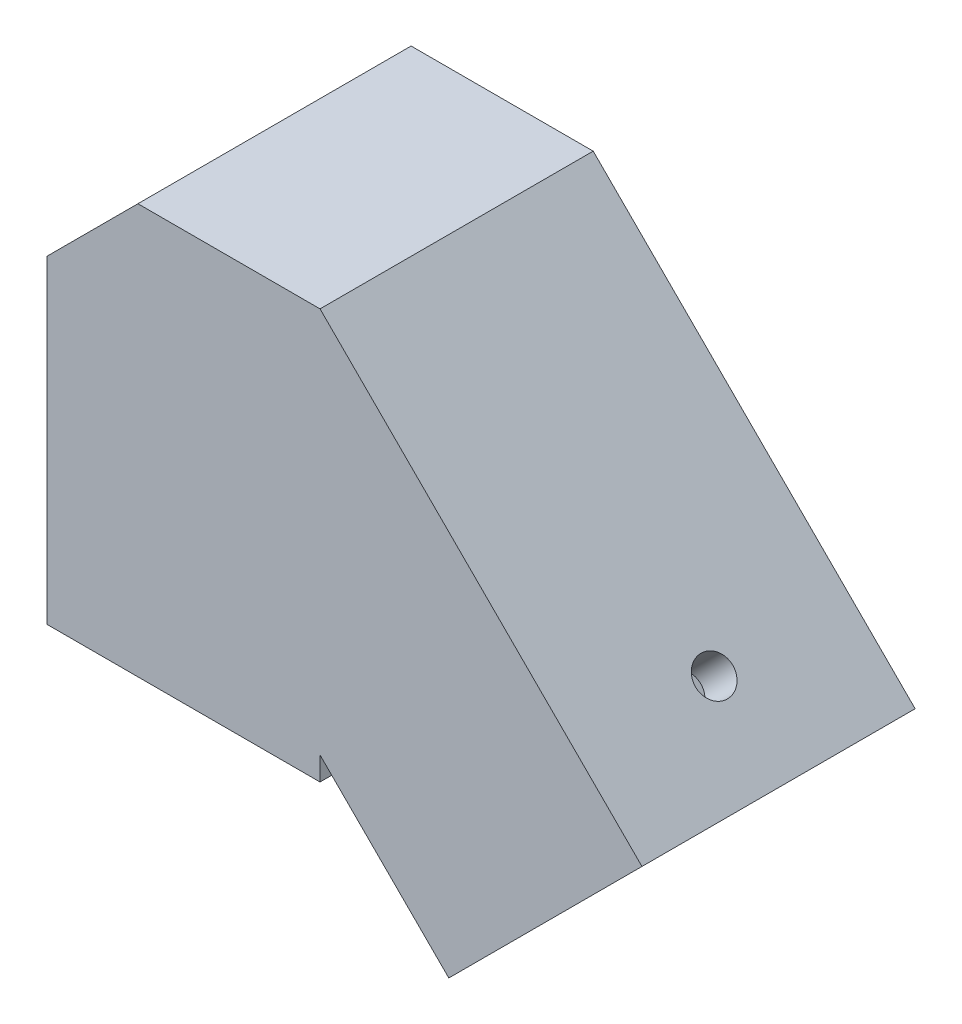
ISO-10303-21;
HEADER;
FILE_DESCRIPTION(('STEP AP214'),'2;1');
FILE_NAME('part.step','',(''),(''),'','','');
FILE_SCHEMA(('AUTOMOTIVE_DESIGN { 1 0 10303 214 1 1 1 1 }'));
ENDSEC;
DATA;
#1=APPLICATION_CONTEXT('core data for automotive mechanical design processes');
#2=APPLICATION_PROTOCOL_DEFINITION('international standard','automotive_design',2000,#1);
#3=PRODUCT_CONTEXT('',#1,'mechanical');
#4=PRODUCT('Part','Part','',(#3));
#5=PRODUCT_RELATED_PRODUCT_CATEGORY('part','',(#4));
#6=PRODUCT_DEFINITION_FORMATION('','',#4);
#7=PRODUCT_DEFINITION_CONTEXT('part definition',#1,'design');
#8=PRODUCT_DEFINITION('design','',#6,#7);
#9=PRODUCT_DEFINITION_SHAPE('','',#8);
#10=(LENGTH_UNIT() NAMED_UNIT(*) SI_UNIT(.MILLI.,.METRE.));
#11=(NAMED_UNIT(*) PLANE_ANGLE_UNIT() SI_UNIT($,.RADIAN.));
#12=(NAMED_UNIT(*) SI_UNIT($,.STERADIAN.) SOLID_ANGLE_UNIT());
#13=UNCERTAINTY_MEASURE_WITH_UNIT(LENGTH_MEASURE(1.E-05),#10,'distance_accuracy_value','');
#14=(GEOMETRIC_REPRESENTATION_CONTEXT(3) GLOBAL_UNCERTAINTY_ASSIGNED_CONTEXT((#13)) GLOBAL_UNIT_ASSIGNED_CONTEXT((#10,
#11,#12)) REPRESENTATION_CONTEXT('',''));
#15=CARTESIAN_POINT('',(0.,0.,0.));
#16=DIRECTION('',(0.,0.,1.));
#17=DIRECTION('',(1.,0.,0.));
#18=AXIS2_PLACEMENT_3D('',#15,#16,#17);
#19=CARTESIAN_POINT('',(15.,-25.,15.));
#20=DIRECTION('',(1.,0.,0.));
#21=DIRECTION('',(0.,0.,-1.));
#22=AXIS2_PLACEMENT_3D('',#19,#20,#21);
#23=PLANE('',#22);
#24=DIRECTION('',(0.,1.,0.));
#25=VECTOR('',#24,1.);
#26=CARTESIAN_POINT('',(15.,-25.,-15.));
#27=LINE('',#26,#25);
#28=CARTESIAN_POINT('',(15.,-25.,-15.));
#29=VERTEX_POINT('',#28);
#30=CARTESIAN_POINT('',(15.,-22.4264068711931,-15.));
#31=VERTEX_POINT('',#30);
#32=EDGE_CURVE('E324',#29,#31,#27,.T.);
#33=ORIENTED_EDGE('',*,*,#32,.T.);
#34=DIRECTION('',(0.,0.,1.));
#35=VECTOR('',#34,1.);
#36=CARTESIAN_POINT('',(15.,-22.4264068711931,-81.7083203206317));
#37=LINE('',#36,#35);
#38=CARTESIAN_POINT('',(15.,-22.4264068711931,15.));
#39=VERTEX_POINT('',#38);
#40=EDGE_CURVE('E284',#31,#39,#37,.T.);
#41=ORIENTED_EDGE('',*,*,#40,.T.);
#42=DIRECTION('',(0.,1.,0.));
#43=VECTOR('',#42,1.);
#44=CARTESIAN_POINT('',(15.,-25.,15.));
#45=LINE('',#44,#43);
#46=CARTESIAN_POINT('',(15.,-25.,15.));
#47=VERTEX_POINT('',#46);
#48=EDGE_CURVE('E321',#47,#39,#45,.T.);
#49=ORIENTED_EDGE('',*,*,#48,.F.);
#50=DIRECTION('',(0.,0.,-1.));
#51=VECTOR('',#50,1.);
#52=CARTESIAN_POINT('',(15.,-25.,15.));
#53=LINE('',#52,#51);
#54=EDGE_CURVE('E304',#47,#29,#53,.T.);
#55=ORIENTED_EDGE('',*,*,#54,.T.);
#56=EDGE_LOOP('',(#33,#41,#49,#55));
#57=FACE_BOUND('',#56,.T.);
#58=ADVANCED_FACE('F50',(#57),#23,.T.);
#59=CARTESIAN_POINT('',(-15.,-25.,15.));
#60=DIRECTION('',(0.,0.,1.));
#61=DIRECTION('',(1.,0.,0.));
#62=AXIS2_PLACEMENT_3D('',#59,#60,#61);
#63=PLANE('',#62);
#64=DIRECTION('',(1.,0.,0.));
#65=VECTOR('',#64,1.);
#66=CARTESIAN_POINT('',(-15.,20.,15.));
#67=LINE('',#66,#65);
#68=CARTESIAN_POINT('',(-5.00000000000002,20.,15.));
#69=VERTEX_POINT('',#68);
#70=CARTESIAN_POINT('',(15.,20.,15.));
#71=VERTEX_POINT('',#70);
#72=EDGE_CURVE('E305',#69,#71,#67,.T.);
#73=ORIENTED_EDGE('',*,*,#72,.F.);
#74=DIRECTION('',(-0.707106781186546,-0.707106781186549,0.));
#75=VECTOR('',#74,1.);
#76=CARTESIAN_POINT('',(-32.5,-7.50000000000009,15.));
#77=LINE('',#76,#75);
#78=CARTESIAN_POINT('',(-15.,9.99999999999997,15.));
#79=VERTEX_POINT('',#78);
#80=EDGE_CURVE('E73',#69,#79,#77,.T.);
#81=ORIENTED_EDGE('',*,*,#80,.T.);
#82=DIRECTION('',(0.,1.,0.));
#83=VECTOR('',#82,1.);
#84=CARTESIAN_POINT('',(-15.,-25.,15.));
#85=LINE('',#84,#83);
#86=CARTESIAN_POINT('',(-15.,-25.,15.));
#87=VERTEX_POINT('',#86);
#88=EDGE_CURVE('E326',#87,#79,#85,.T.);
#89=ORIENTED_EDGE('',*,*,#88,.F.);
#90=DIRECTION('',(1.,0.,0.));
#91=VECTOR('',#90,1.);
#92=CARTESIAN_POINT('',(-15.,-25.,15.));
#93=LINE('',#92,#91);
#94=EDGE_CURVE('E320',#87,#47,#93,.T.);
#95=ORIENTED_EDGE('',*,*,#94,.T.);
#96=ORIENTED_EDGE('',*,*,#48,.T.);
#97=DIRECTION('',(0.707106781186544,-0.707106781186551,0.));
#98=VECTOR('',#97,1.);
#99=CARTESIAN_POINT('',(15.,-22.4264068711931,15.));
#100=LINE('',#99,#98);
#101=CARTESIAN_POINT('',(29.1421356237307,-36.5685424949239,15.));
#102=VERTEX_POINT('',#101);
#103=EDGE_CURVE('E255',#39,#102,#100,.T.);
#104=ORIENTED_EDGE('',*,*,#103,.T.);
#105=DIRECTION('',(0.707106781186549,0.707106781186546,0.));
#106=VECTOR('',#105,1.);
#107=CARTESIAN_POINT('',(29.1421356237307,-36.5685424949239,15.));
#108=LINE('',#107,#106);
#109=CARTESIAN_POINT('',(50.3553390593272,-15.3553390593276,15.));
#110=VERTEX_POINT('',#109);
#111=EDGE_CURVE('E269',#102,#110,#108,.T.);
#112=ORIENTED_EDGE('',*,*,#111,.T.);
#113=DIRECTION('',(-0.707106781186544,0.707106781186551,0.));
#114=VECTOR('',#113,1.);
#115=CARTESIAN_POINT('',(15.,20.,15.));
#116=LINE('',#115,#114);
#117=EDGE_CURVE('E261',#110,#71,#116,.T.);
#118=ORIENTED_EDGE('',*,*,#117,.T.);
#119=EDGE_LOOP('',(#73,#81,#89,#95,#96,#104,#112,#118));
#120=FACE_BOUND('',#119,.T.);
#121=ADVANCED_FACE('F350',(#120),#63,.T.);
#122=CARTESIAN_POINT('',(-15.,-25.,15.));
#123=DIRECTION('',(-1.,0.,0.));
#124=DIRECTION('',(0.,0.,1.));
#125=AXIS2_PLACEMENT_3D('',#122,#123,#124);
#126=PLANE('',#125);
#127=CARTESIAN_POINT('',(-15.,-15.,0.));
#128=DIRECTION('',(-1.,0.,0.));
#129=DIRECTION('',(0.,0.,1.));
#130=AXIS2_PLACEMENT_3D('',#127,#128,#129);
#131=CIRCLE('',#130,2.05);
#132=CARTESIAN_POINT('',(-15.,-15.,2.05));
#133=VERTEX_POINT('',#132);
#134=EDGE_CURVE('E437',#133,#133,#131,.T.);
#135=ORIENTED_EDGE('',*,*,#134,.F.);
#136=EDGE_LOOP('',(#135));
#137=FACE_BOUND('',#136,.T.);
#138=ORIENTED_EDGE('',*,*,#88,.T.);
#139=DIRECTION('',(0.,0.,-1.));
#140=VECTOR('',#139,1.);
#141=CARTESIAN_POINT('',(-15.,9.99999999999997,-15.));
#142=LINE('',#141,#140);
#143=CARTESIAN_POINT('',(-15.,9.99999999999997,-15.));
#144=VERTEX_POINT('',#143);
#145=EDGE_CURVE('E60',#79,#144,#142,.T.);
#146=ORIENTED_EDGE('',*,*,#145,.T.);
#147=DIRECTION('',(0.,1.,0.));
#148=VECTOR('',#147,1.);
#149=CARTESIAN_POINT('',(-15.,-25.,-15.));
#150=LINE('',#149,#148);
#151=CARTESIAN_POINT('',(-15.,-25.,-15.));
#152=VERTEX_POINT('',#151);
#153=EDGE_CURVE('E327',#152,#144,#150,.T.);
#154=ORIENTED_EDGE('',*,*,#153,.F.);
#155=DIRECTION('',(0.,0.,1.));
#156=VECTOR('',#155,1.);
#157=CARTESIAN_POINT('',(-15.,-25.,15.));
#158=LINE('',#157,#156);
#159=EDGE_CURVE('E312',#152,#87,#158,.T.);
#160=ORIENTED_EDGE('',*,*,#159,.T.);
#161=EDGE_LOOP('',(#138,#146,#154,#160));
#162=FACE_BOUND('',#161,.T.);
#163=ADVANCED_FACE('F372',(#137,#162),#126,.T.);
#164=CARTESIAN_POINT('',(-15.,-25.,-15.));
#165=DIRECTION('',(0.,0.,-1.));
#166=DIRECTION('',(-1.,0.,0.));
#167=AXIS2_PLACEMENT_3D('',#164,#165,#166);
#168=PLANE('',#167);
#169=ORIENTED_EDGE('',*,*,#153,.T.);
#170=DIRECTION('',(0.707106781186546,0.707106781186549,0.));
#171=VECTOR('',#170,1.);
#172=CARTESIAN_POINT('',(-32.5,-7.50000000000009,-15.));
#173=LINE('',#172,#171);
#174=CARTESIAN_POINT('',(-5.00000000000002,20.,-15.));
#175=VERTEX_POINT('',#174);
#176=EDGE_CURVE('E11',#144,#175,#173,.T.);
#177=ORIENTED_EDGE('',*,*,#176,.T.);
#178=DIRECTION('',(-1.,0.,0.));
#179=VECTOR('',#178,1.);
#180=CARTESIAN_POINT('',(-15.,20.,-15.));
#181=LINE('',#180,#179);
#182=CARTESIAN_POINT('',(15.,20.,-15.));
#183=VERTEX_POINT('',#182);
#184=EDGE_CURVE('E296',#183,#175,#181,.T.);
#185=ORIENTED_EDGE('',*,*,#184,.F.);
#186=DIRECTION('',(-0.707106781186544,0.707106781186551,0.));
#187=VECTOR('',#186,1.);
#188=CARTESIAN_POINT('',(15.,20.,-15.));
#189=LINE('',#188,#187);
#190=CARTESIAN_POINT('',(50.3553390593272,-15.3553390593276,-15.));
#191=VERTEX_POINT('',#190);
#192=EDGE_CURVE('E280',#191,#183,#189,.T.);
#193=ORIENTED_EDGE('',*,*,#192,.F.);
#194=DIRECTION('',(0.707106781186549,0.707106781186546,0.));
#195=VECTOR('',#194,1.);
#196=CARTESIAN_POINT('',(29.1421356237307,-36.5685424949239,-15.));
#197=LINE('',#196,#195);
#198=CARTESIAN_POINT('',(29.1421356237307,-36.5685424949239,-15.));
#199=VERTEX_POINT('',#198);
#200=EDGE_CURVE('E285',#199,#191,#197,.T.);
#201=ORIENTED_EDGE('',*,*,#200,.F.);
#202=DIRECTION('',(0.707106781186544,-0.707106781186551,0.));
#203=VECTOR('',#202,1.);
#204=CARTESIAN_POINT('',(15.,-22.4264068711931,-15.));
#205=LINE('',#204,#203);
#206=EDGE_CURVE('E268',#31,#199,#205,.T.);
#207=ORIENTED_EDGE('',*,*,#206,.F.);
#208=ORIENTED_EDGE('',*,*,#32,.F.);
#209=DIRECTION('',(-1.,0.,0.));
#210=VECTOR('',#209,1.);
#211=CARTESIAN_POINT('',(-15.,-25.,-15.));
#212=LINE('',#211,#210);
#213=EDGE_CURVE('E307',#29,#152,#212,.T.);
#214=ORIENTED_EDGE('',*,*,#213,.T.);
#215=EDGE_LOOP('',(#169,#177,#185,#193,#201,#207,#208,#214));
#216=FACE_BOUND('',#215,.T.);
#217=ADVANCED_FACE('F351',(#216),#168,.T.);
#218=CARTESIAN_POINT('',(0.,-25.,0.));
#219=DIRECTION('',(0.,-1.,0.));
#220=DIRECTION('',(0.,0.,-1.));
#221=AXIS2_PLACEMENT_3D('',#218,#219,#220);
#222=PLANE('',#221);
#223=DIRECTION('',(0.,0.,1.));
#224=VECTOR('',#223,1.);
#225=CARTESIAN_POINT('',(10.025,-25.,-10.025));
#226=LINE('',#225,#224);
#227=CARTESIAN_POINT('',(10.025,-25.,-10.025));
#228=VERTEX_POINT('',#227);
#229=CARTESIAN_POINT('',(10.025,-25.,10.025));
#230=VERTEX_POINT('',#229);
#231=EDGE_CURVE('E211',#228,#230,#226,.T.);
#232=ORIENTED_EDGE('',*,*,#231,.F.);
#233=DIRECTION('',(1.,0.,0.));
#234=VECTOR('',#233,1.);
#235=CARTESIAN_POINT('',(-10.025,-25.,-10.025));
#236=LINE('',#235,#234);
#237=CARTESIAN_POINT('',(-10.025,-25.,-10.025));
#238=VERTEX_POINT('',#237);
#239=EDGE_CURVE('E222',#238,#228,#236,.T.);
#240=ORIENTED_EDGE('',*,*,#239,.F.);
#241=DIRECTION('',(0.,0.,-1.));
#242=VECTOR('',#241,1.);
#243=CARTESIAN_POINT('',(-10.025,-25.,-10.025));
#244=LINE('',#243,#242);
#245=CARTESIAN_POINT('',(-10.025,-25.,10.025));
#246=VERTEX_POINT('',#245);
#247=EDGE_CURVE('E245',#246,#238,#244,.T.);
#248=ORIENTED_EDGE('',*,*,#247,.F.);
#249=DIRECTION('',(-1.,0.,0.));
#250=VECTOR('',#249,1.);
#251=CARTESIAN_POINT('',(-10.025,-25.,10.025));
#252=LINE('',#251,#250);
#253=EDGE_CURVE('E238',#230,#246,#252,.T.);
#254=ORIENTED_EDGE('',*,*,#253,.F.);
#255=EDGE_LOOP('',(#232,#240,#248,#254));
#256=FACE_BOUND('',#255,.T.);
#257=ORIENTED_EDGE('',*,*,#54,.F.);
#258=ORIENTED_EDGE('',*,*,#94,.F.);
#259=ORIENTED_EDGE('',*,*,#159,.F.);
#260=ORIENTED_EDGE('',*,*,#213,.F.);
#261=EDGE_LOOP('',(#257,#258,#259,#260));
#262=FACE_BOUND('',#261,.T.);
#263=ADVANCED_FACE('F378',(#256,#262),#222,.T.);
#264=CARTESIAN_POINT('',(0.,20.,0.));
#265=DIRECTION('',(0.,-1.,0.));
#266=DIRECTION('',(0.,0.,-1.));
#267=AXIS2_PLACEMENT_3D('',#264,#265,#266);
#268=PLANE('',#267);
#269=ORIENTED_EDGE('',*,*,#184,.T.);
#270=DIRECTION('',(0.,0.,1.));
#271=VECTOR('',#270,1.);
#272=CARTESIAN_POINT('',(-5.00000000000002,20.,15.));
#273=LINE('',#272,#271);
#274=EDGE_CURVE('E329',#175,#69,#273,.T.);
#275=ORIENTED_EDGE('',*,*,#274,.T.);
#276=ORIENTED_EDGE('',*,*,#72,.T.);
#277=DIRECTION('',(0.,0.,-1.));
#278=VECTOR('',#277,1.);
#279=CARTESIAN_POINT('',(15.,20.,15.));
#280=LINE('',#279,#278);
#281=EDGE_CURVE('E295',#71,#183,#280,.T.);
#282=ORIENTED_EDGE('',*,*,#281,.T.);
#283=EDGE_LOOP('',(#269,#275,#276,#282));
#284=FACE_BOUND('',#283,.T.);
#285=ADVANCED_FACE('F345',(#284),#268,.F.);
#286=CARTESIAN_POINT('',(15.,-22.4264068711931,-81.7083203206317));
#287=DIRECTION('',(-0.707106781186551,-0.707106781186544,0.));
#288=DIRECTION('',(0.707106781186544,-0.707106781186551,0.));
#289=AXIS2_PLACEMENT_3D('',#286,#287,#288);
#290=PLANE('',#289);
#291=ORIENTED_EDGE('',*,*,#40,.F.);
#292=ORIENTED_EDGE('',*,*,#206,.T.);
#293=DIRECTION('',(0.,0.,1.));
#294=VECTOR('',#293,1.);
#295=CARTESIAN_POINT('',(29.1421356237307,-36.5685424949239,-81.7083203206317));
#296=LINE('',#295,#294);
#297=EDGE_CURVE('E276',#199,#102,#296,.T.);
#298=ORIENTED_EDGE('',*,*,#297,.T.);
#299=ORIENTED_EDGE('',*,*,#103,.F.);
#300=EDGE_LOOP('',(#291,#292,#298,#299));
#301=FACE_BOUND('',#300,.T.);
#302=ADVANCED_FACE('F386',(#301),#290,.T.);
#303=CARTESIAN_POINT('',(29.1421356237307,-36.5685424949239,-81.7083203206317));
#304=DIRECTION('',(0.707106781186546,-0.707106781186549,0.));
#305=DIRECTION('',(0.707106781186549,0.707106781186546,0.));
#306=AXIS2_PLACEMENT_3D('',#303,#304,#305);
#307=PLANE('',#306);
#308=DIRECTION('',(0.707106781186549,0.707106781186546,0.));
#309=VECTOR('',#308,1.);
#310=CARTESIAN_POINT('',(32.6599918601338,-33.0506862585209,-10.025));
#311=LINE('',#310,#309);
#312=CARTESIAN_POINT('',(32.6599918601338,-33.0506862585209,-10.025));
#313=VERTEX_POINT('',#312);
#314=CARTESIAN_POINT('',(46.8374828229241,-18.8731952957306,-10.025));
#315=VERTEX_POINT('',#314);
#316=EDGE_CURVE('E170',#313,#315,#311,.T.);
#317=ORIENTED_EDGE('',*,*,#316,.F.);
#318=DIRECTION('',(0.,0.,-1.));
#319=VECTOR('',#318,1.);
#320=CARTESIAN_POINT('',(32.6599918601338,-33.0506862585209,10.025));
#321=LINE('',#320,#319);
#322=CARTESIAN_POINT('',(32.6599918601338,-33.0506862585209,10.025));
#323=VERTEX_POINT('',#322);
#324=EDGE_CURVE('E190',#323,#313,#321,.T.);
#325=ORIENTED_EDGE('',*,*,#324,.F.);
#326=DIRECTION('',(-0.707106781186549,-0.707106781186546,0.));
#327=VECTOR('',#326,1.);
#328=CARTESIAN_POINT('',(32.6599918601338,-33.0506862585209,10.025));
#329=LINE('',#328,#327);
#330=CARTESIAN_POINT('',(46.8374828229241,-18.8731952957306,10.025));
#331=VERTEX_POINT('',#330);
#332=EDGE_CURVE('E194',#331,#323,#329,.T.);
#333=ORIENTED_EDGE('',*,*,#332,.F.);
#334=DIRECTION('',(0.,0.,1.));
#335=VECTOR('',#334,1.);
#336=CARTESIAN_POINT('',(46.8374828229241,-18.8731952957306,10.025));
#337=LINE('',#336,#335);
#338=EDGE_CURVE('E202',#315,#331,#337,.T.);
#339=ORIENTED_EDGE('',*,*,#338,.F.);
#340=EDGE_LOOP('',(#317,#325,#333,#339));
#341=FACE_BOUND('',#340,.T.);
#342=ORIENTED_EDGE('',*,*,#297,.F.);
#343=ORIENTED_EDGE('',*,*,#200,.T.);
#344=DIRECTION('',(0.,0.,1.));
#345=VECTOR('',#344,1.);
#346=CARTESIAN_POINT('',(50.3553390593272,-15.3553390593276,-81.7083203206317));
#347=LINE('',#346,#345);
#348=EDGE_CURVE('E281',#191,#110,#347,.T.);
#349=ORIENTED_EDGE('',*,*,#348,.T.);
#350=ORIENTED_EDGE('',*,*,#111,.F.);
#351=EDGE_LOOP('',(#342,#343,#349,#350));
#352=FACE_BOUND('',#351,.T.);
#353=ADVANCED_FACE('F388',(#341,#352),#307,.T.);
#354=CARTESIAN_POINT('',(15.,20.,-81.7083203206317));
#355=DIRECTION('',(0.707106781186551,0.707106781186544,0.));
#356=DIRECTION('',(-0.707106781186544,0.707106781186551,0.));
#357=AXIS2_PLACEMENT_3D('',#354,#355,#356);
#358=PLANE('',#357);
#359=CARTESIAN_POINT('',(43.2842712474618,-8.28427124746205,0.));
#360=DIRECTION('',(0.707106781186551,0.707106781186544,0.));
#361=DIRECTION('',(-0.707106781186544,0.707106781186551,0.));
#362=AXIS2_PLACEMENT_3D('',#359,#360,#361);
#363=CIRCLE('',#362,2.05);
#364=CARTESIAN_POINT('',(41.8347023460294,-6.83470234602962,0.));
#365=VERTEX_POINT('',#364);
#366=EDGE_CURVE('E442',#365,#365,#363,.T.);
#367=ORIENTED_EDGE('',*,*,#366,.F.);
#368=EDGE_LOOP('',(#367));
#369=FACE_BOUND('',#368,.T.);
#370=ORIENTED_EDGE('',*,*,#348,.F.);
#371=ORIENTED_EDGE('',*,*,#192,.T.);
#372=ORIENTED_EDGE('',*,*,#281,.F.);
#373=ORIENTED_EDGE('',*,*,#117,.F.);
#374=EDGE_LOOP('',(#370,#371,#372,#373));
#375=FACE_BOUND('',#374,.T.);
#376=ADVANCED_FACE('F352',(#369,#375),#358,.T.);
#377=CARTESIAN_POINT('',(10.025,-5.,-10.025));
#378=DIRECTION('',(1.,0.,0.));
#379=DIRECTION('',(0.,0.,-1.));
#380=AXIS2_PLACEMENT_3D('',#377,#378,#379);
#381=PLANE('',#380);
#382=ORIENTED_EDGE('',*,*,#231,.T.);
#383=DIRECTION('',(0.,-1.,0.));
#384=VECTOR('',#383,1.);
#385=CARTESIAN_POINT('',(10.025,-5.,10.025));
#386=LINE('',#385,#384);
#387=CARTESIAN_POINT('',(10.025,-5.,10.025));
#388=VERTEX_POINT('',#387);
#389=EDGE_CURVE('E232',#388,#230,#386,.T.);
#390=ORIENTED_EDGE('',*,*,#389,.F.);
#391=DIRECTION('',(0.,0.,1.));
#392=VECTOR('',#391,1.);
#393=CARTESIAN_POINT('',(10.025,-5.,-10.025));
#394=LINE('',#393,#392);
#395=CARTESIAN_POINT('',(10.025,-5.,-10.025));
#396=VERTEX_POINT('',#395);
#397=EDGE_CURVE('E220',#396,#388,#394,.T.);
#398=ORIENTED_EDGE('',*,*,#397,.F.);
#399=DIRECTION('',(0.,-1.,0.));
#400=VECTOR('',#399,1.);
#401=CARTESIAN_POINT('',(10.025,-5.,-10.025));
#402=LINE('',#401,#400);
#403=EDGE_CURVE('E248',#396,#228,#402,.T.);
#404=ORIENTED_EDGE('',*,*,#403,.T.);
#405=EDGE_LOOP('',(#382,#390,#398,#404));
#406=FACE_BOUND('',#405,.T.);
#407=ADVANCED_FACE('F392',(#406),#381,.F.);
#408=CARTESIAN_POINT('',(-10.025,-5.,-10.025));
#409=DIRECTION('',(0.,0.,-1.));
#410=DIRECTION('',(-1.,0.,0.));
#411=AXIS2_PLACEMENT_3D('',#408,#409,#410);
#412=PLANE('',#411);
#413=ORIENTED_EDGE('',*,*,#239,.T.);
#414=ORIENTED_EDGE('',*,*,#403,.F.);
#415=DIRECTION('',(1.,0.,0.));
#416=VECTOR('',#415,1.);
#417=CARTESIAN_POINT('',(-10.025,-5.,-10.025));
#418=LINE('',#417,#416);
#419=CARTESIAN_POINT('',(-10.025,-5.,-10.025));
#420=VERTEX_POINT('',#419);
#421=EDGE_CURVE('E233',#420,#396,#418,.T.);
#422=ORIENTED_EDGE('',*,*,#421,.F.);
#423=DIRECTION('',(0.,-1.,0.));
#424=VECTOR('',#423,1.);
#425=CARTESIAN_POINT('',(-10.025,-5.,-10.025));
#426=LINE('',#425,#424);
#427=EDGE_CURVE('E254',#420,#238,#426,.T.);
#428=ORIENTED_EDGE('',*,*,#427,.T.);
#429=EDGE_LOOP('',(#413,#414,#422,#428));
#430=FACE_BOUND('',#429,.T.);
#431=ADVANCED_FACE('F400',(#430),#412,.F.);
#432=CARTESIAN_POINT('',(-10.025,-5.,-10.025));
#433=DIRECTION('',(-1.,0.,0.));
#434=DIRECTION('',(0.,0.,1.));
#435=AXIS2_PLACEMENT_3D('',#432,#433,#434);
#436=PLANE('',#435);
#437=CARTESIAN_POINT('',(-10.025,-15.,0.));
#438=DIRECTION('',(-1.,0.,0.));
#439=DIRECTION('',(0.,0.,1.));
#440=AXIS2_PLACEMENT_3D('',#437,#438,#439);
#441=CIRCLE('',#440,2.05);
#442=CARTESIAN_POINT('',(-10.025,-15.,2.05));
#443=VERTEX_POINT('',#442);
#444=EDGE_CURVE('E436',#443,#443,#441,.F.);
#445=ORIENTED_EDGE('',*,*,#444,.F.);
#446=EDGE_LOOP('',(#445));
#447=FACE_BOUND('',#446,.T.);
#448=ORIENTED_EDGE('',*,*,#247,.T.);
#449=ORIENTED_EDGE('',*,*,#427,.F.);
#450=DIRECTION('',(0.,0.,-1.));
#451=VECTOR('',#450,1.);
#452=CARTESIAN_POINT('',(-10.025,-5.,-10.025));
#453=LINE('',#452,#451);
#454=CARTESIAN_POINT('',(-10.025,-5.,10.025));
#455=VERTEX_POINT('',#454);
#456=EDGE_CURVE('E227',#455,#420,#453,.T.);
#457=ORIENTED_EDGE('',*,*,#456,.F.);
#458=DIRECTION('',(0.,-1.,0.));
#459=VECTOR('',#458,1.);
#460=CARTESIAN_POINT('',(-10.025,-5.,10.025));
#461=LINE('',#460,#459);
#462=EDGE_CURVE('E259',#455,#246,#461,.T.);
#463=ORIENTED_EDGE('',*,*,#462,.T.);
#464=EDGE_LOOP('',(#448,#449,#457,#463));
#465=FACE_BOUND('',#464,.T.);
#466=ADVANCED_FACE('F403',(#447,#465),#436,.F.);
#467=CARTESIAN_POINT('',(-10.025,-5.,10.025));
#468=DIRECTION('',(0.,0.,1.));
#469=DIRECTION('',(1.,0.,0.));
#470=AXIS2_PLACEMENT_3D('',#467,#468,#469);
#471=PLANE('',#470);
#472=ORIENTED_EDGE('',*,*,#253,.T.);
#473=ORIENTED_EDGE('',*,*,#462,.F.);
#474=DIRECTION('',(-1.,0.,0.));
#475=VECTOR('',#474,1.);
#476=CARTESIAN_POINT('',(-10.025,-5.,10.025));
#477=LINE('',#476,#475);
#478=EDGE_CURVE('E224',#388,#455,#477,.T.);
#479=ORIENTED_EDGE('',*,*,#478,.F.);
#480=ORIENTED_EDGE('',*,*,#389,.T.);
#481=EDGE_LOOP('',(#472,#473,#479,#480));
#482=FACE_BOUND('',#481,.T.);
#483=ADVANCED_FACE('F402',(#482),#471,.F.);
#484=CARTESIAN_POINT('',(0.,-5.,0.));
#485=DIRECTION('',(0.,1.,0.));
#486=DIRECTION('',(0.,0.,1.));
#487=AXIS2_PLACEMENT_3D('',#484,#485,#486);
#488=PLANE('',#487);
#489=ORIENTED_EDGE('',*,*,#397,.T.);
#490=ORIENTED_EDGE('',*,*,#478,.T.);
#491=ORIENTED_EDGE('',*,*,#456,.T.);
#492=ORIENTED_EDGE('',*,*,#421,.T.);
#493=EDGE_LOOP('',(#489,#490,#491,#492));
#494=FACE_BOUND('',#493,.T.);
#495=ADVANCED_FACE('F404',(#494),#488,.F.);
#496=CARTESIAN_POINT('',(14.9823223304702,-15.3730167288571,-10.025));
#497=DIRECTION('',(0.,0.,-1.));
#498=DIRECTION('',(-1.,0.,0.));
#499=AXIS2_PLACEMENT_3D('',#496,#497,#498);
#500=PLANE('',#499);
#501=ORIENTED_EDGE('',*,*,#316,.T.);
#502=DIRECTION('',(0.707106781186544,-0.707106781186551,0.));
#503=VECTOR('',#502,1.);
#504=CARTESIAN_POINT('',(29.1598132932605,-1.19552576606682,-10.025));
#505=LINE('',#504,#503);
#506=CARTESIAN_POINT('',(29.1598132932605,-1.19552576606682,-10.025));
#507=VERTEX_POINT('',#506);
#508=EDGE_CURVE('E156',#507,#315,#505,.T.);
#509=ORIENTED_EDGE('',*,*,#508,.F.);
#510=DIRECTION('',(0.707106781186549,0.707106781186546,0.));
#511=VECTOR('',#510,1.);
#512=CARTESIAN_POINT('',(14.9823223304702,-15.3730167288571,-10.025));
#513=LINE('',#512,#511);
#514=CARTESIAN_POINT('',(14.9823223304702,-15.3730167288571,-10.025));
#515=VERTEX_POINT('',#514);
#516=EDGE_CURVE('E165',#515,#507,#513,.T.);
#517=ORIENTED_EDGE('',*,*,#516,.F.);
#518=DIRECTION('',(0.707106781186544,-0.707106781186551,0.));
#519=VECTOR('',#518,1.);
#520=CARTESIAN_POINT('',(14.9823223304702,-15.3730167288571,-10.025));
#521=LINE('',#520,#519);
#522=EDGE_CURVE('E209',#515,#313,#521,.T.);
#523=ORIENTED_EDGE('',*,*,#522,.T.);
#524=EDGE_LOOP('',(#501,#509,#517,#523));
#525=FACE_BOUND('',#524,.T.);
#526=ADVANCED_FACE('F162',(#525),#500,.F.);
#527=CARTESIAN_POINT('',(14.9823223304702,-15.3730167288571,10.025));
#528=DIRECTION('',(-0.707106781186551,-0.707106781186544,0.));
#529=DIRECTION('',(0.707106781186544,-0.707106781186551,0.));
#530=AXIS2_PLACEMENT_3D('',#527,#528,#529);
#531=PLANE('',#530);
#532=ORIENTED_EDGE('',*,*,#324,.T.);
#533=ORIENTED_EDGE('',*,*,#522,.F.);
#534=DIRECTION('',(0.,0.,-1.));
#535=VECTOR('',#534,1.);
#536=CARTESIAN_POINT('',(14.9823223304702,-15.3730167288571,10.025));
#537=LINE('',#536,#535);
#538=CARTESIAN_POINT('',(14.9823223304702,-15.3730167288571,10.025));
#539=VERTEX_POINT('',#538);
#540=EDGE_CURVE('E173',#539,#515,#537,.T.);
#541=ORIENTED_EDGE('',*,*,#540,.F.);
#542=DIRECTION('',(0.707106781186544,-0.707106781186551,0.));
#543=VECTOR('',#542,1.);
#544=CARTESIAN_POINT('',(14.9823223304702,-15.3730167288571,10.025));
#545=LINE('',#544,#543);
#546=EDGE_CURVE('E215',#539,#323,#545,.T.);
#547=ORIENTED_EDGE('',*,*,#546,.T.);
#548=EDGE_LOOP('',(#532,#533,#541,#547));
#549=FACE_BOUND('',#548,.T.);
#550=ADVANCED_FACE('F417',(#549),#531,.F.);
#551=CARTESIAN_POINT('',(14.9823223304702,-15.3730167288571,10.025));
#552=DIRECTION('',(0.,0.,1.));
#553=DIRECTION('',(1.,0.,0.));
#554=AXIS2_PLACEMENT_3D('',#551,#552,#553);
#555=PLANE('',#554);
#556=ORIENTED_EDGE('',*,*,#332,.T.);
#557=ORIENTED_EDGE('',*,*,#546,.F.);
#558=DIRECTION('',(-0.707106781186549,-0.707106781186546,0.));
#559=VECTOR('',#558,1.);
#560=CARTESIAN_POINT('',(14.9823223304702,-15.3730167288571,10.025));
#561=LINE('',#560,#559);
#562=CARTESIAN_POINT('',(29.1598132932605,-1.19552576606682,10.025));
#563=VERTEX_POINT('',#562);
#564=EDGE_CURVE('E185',#563,#539,#561,.T.);
#565=ORIENTED_EDGE('',*,*,#564,.F.);
#566=DIRECTION('',(0.707106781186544,-0.707106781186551,0.));
#567=VECTOR('',#566,1.);
#568=CARTESIAN_POINT('',(29.1598132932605,-1.19552576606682,10.025));
#569=LINE('',#568,#567);
#570=EDGE_CURVE('E175',#563,#331,#569,.T.);
#571=ORIENTED_EDGE('',*,*,#570,.T.);
#572=EDGE_LOOP('',(#556,#557,#565,#571));
#573=FACE_BOUND('',#572,.T.);
#574=ADVANCED_FACE('F423',(#573),#555,.F.);
#575=CARTESIAN_POINT('',(29.1598132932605,-1.19552576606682,10.025));
#576=DIRECTION('',(0.707106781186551,0.707106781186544,0.));
#577=DIRECTION('',(-0.707106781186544,0.707106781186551,0.));
#578=AXIS2_PLACEMENT_3D('',#575,#576,#577);
#579=PLANE('',#578);
#580=CARTESIAN_POINT('',(39.7664150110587,-11.8021274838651,0.));
#581=DIRECTION('',(0.707106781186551,0.707106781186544,0.));
#582=DIRECTION('',(-0.707106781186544,0.707106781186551,0.));
#583=AXIS2_PLACEMENT_3D('',#580,#581,#582);
#584=CIRCLE('',#583,2.05);
#585=CARTESIAN_POINT('',(38.3168461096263,-10.3525585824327,0.));
#586=VERTEX_POINT('',#585);
#587=EDGE_CURVE('E193',#586,#586,#584,.F.);
#588=ORIENTED_EDGE('',*,*,#587,.F.);
#589=EDGE_LOOP('',(#588));
#590=FACE_BOUND('',#589,.T.);
#591=ORIENTED_EDGE('',*,*,#338,.T.);
#592=ORIENTED_EDGE('',*,*,#570,.F.);
#593=DIRECTION('',(0.,0.,1.));
#594=VECTOR('',#593,1.);
#595=CARTESIAN_POINT('',(29.1598132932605,-1.19552576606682,10.025));
#596=LINE('',#595,#594);
#597=EDGE_CURVE('E176',#507,#563,#596,.T.);
#598=ORIENTED_EDGE('',*,*,#597,.F.);
#599=ORIENTED_EDGE('',*,*,#508,.T.);
#600=EDGE_LOOP('',(#591,#592,#598,#599));
#601=FACE_BOUND('',#600,.T.);
#602=ADVANCED_FACE('F180',(#590,#601),#579,.F.);
#603=CARTESIAN_POINT('',(15.1776695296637,-15.1776695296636,0.));
#604=DIRECTION('',(-0.707106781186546,0.707106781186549,0.));
#605=DIRECTION('',(-0.707106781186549,-0.707106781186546,0.));
#606=AXIS2_PLACEMENT_3D('',#603,#604,#605);
#607=PLANE('',#606);
#608=ORIENTED_EDGE('',*,*,#516,.T.);
#609=ORIENTED_EDGE('',*,*,#597,.T.);
#610=ORIENTED_EDGE('',*,*,#564,.T.);
#611=ORIENTED_EDGE('',*,*,#540,.T.);
#612=EDGE_LOOP('',(#608,#609,#610,#611));
#613=FACE_BOUND('',#612,.T.);
#614=ADVANCED_FACE('F183',(#613),#607,.F.);
#615=CARTESIAN_POINT('',(-5.00000000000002,20.,0.));
#616=DIRECTION('',(-0.707106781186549,0.707106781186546,0.));
#617=DIRECTION('',(0.,0.,-1.));
#618=AXIS2_PLACEMENT_3D('',#615,#616,#617);
#619=PLANE('',#618);
#620=ORIENTED_EDGE('',*,*,#176,.F.);
#621=ORIENTED_EDGE('',*,*,#145,.F.);
#622=ORIENTED_EDGE('',*,*,#80,.F.);
#623=ORIENTED_EDGE('',*,*,#274,.F.);
#624=EDGE_LOOP('',(#620,#621,#622,#623));
#625=FACE_BOUND('',#624,.T.);
#626=ADVANCED_FACE('F49',(#625),#619,.T.);
#627=CARTESIAN_POINT('',(35.6664150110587,-15.9021274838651,0.));
#628=DIRECTION('',(0.707106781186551,0.707106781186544,0.));
#629=DIRECTION('',(-0.707106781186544,0.707106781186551,0.));
#630=AXIS2_PLACEMENT_3D('',#627,#628,#629);
#631=CYLINDRICAL_SURFACE('',#630,2.05);
#632=ORIENTED_EDGE('',*,*,#587,.T.);
#633=EDGE_LOOP('',(#632));
#634=FACE_BOUND('',#633,.T.);
#635=ORIENTED_EDGE('',*,*,#366,.T.);
#636=EDGE_LOOP('',(#635));
#637=FACE_BOUND('',#636,.T.);
#638=ADVANCED_FACE('F357',(#634,#637),#631,.F.);
#639=CARTESIAN_POINT('',(-4.22672439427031,-15.,0.));
#640=DIRECTION('',(-1.,0.,0.));
#641=DIRECTION('',(0.,0.,1.));
#642=AXIS2_PLACEMENT_3D('',#639,#640,#641);
#643=CYLINDRICAL_SURFACE('',#642,2.05);
#644=ORIENTED_EDGE('',*,*,#444,.T.);
#645=EDGE_LOOP('',(#644));
#646=FACE_BOUND('',#645,.T.);
#647=ORIENTED_EDGE('',*,*,#134,.T.);
#648=EDGE_LOOP('',(#647));
#649=FACE_BOUND('',#648,.T.);
#650=ADVANCED_FACE('F361',(#646,#649),#643,.F.);
#651=CLOSED_SHELL('',(#58,#121,#163,#217,#263,#285,#302,#353,#376,#407,#431,#466,#483,#495,#526,
#550,#574,#602,#614,#626,#638,#650));
#652=MANIFOLD_SOLID_BREP('B2',#651);
#653=ADVANCED_BREP_SHAPE_REPRESENTATION('',(#18,#652),#14);
#654=SHAPE_DEFINITION_REPRESENTATION(#9,#653);
ENDSEC;
END-ISO-10303-21;
